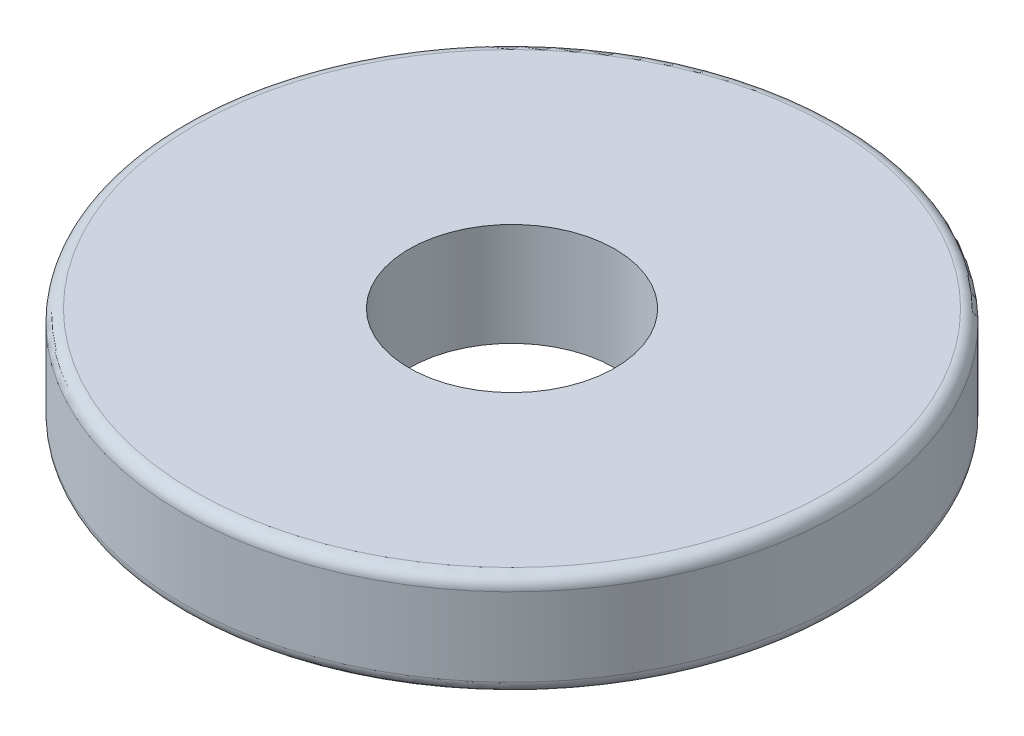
from build123d import *

# Parameters (mm, degrees)
ESQUISSE1_W = 5.5
ESQUISSE1_H = 2.5
CONG_1_R    = 0.3


with BuildPart() as part:
    # Esquisse1 → R_volution1 (revolve)
    with BuildSketch(Plane.XY, mode=Mode.PRIVATE) as r_volution1_sk:
        with Locations((5.25, 2.25)):
            Rectangle(ESQUISSE1_W, ESQUISSE1_H)
    revolve(r_volution1_sk.sketch.rotate(Axis((0, 0, 0), (0, 1, 0)), 90), axis=Axis((0, 0, 0), (0, 1, 0)))

    # Cong_1
    cong_1_edges = [part.edges().sort_by_distance(p)[0] for p in [
        (0, 1, 8),
        (0, 3.5, 8),
    ]]
    fillet(cong_1_edges, radius=CONG_1_R)


solid = part.part
